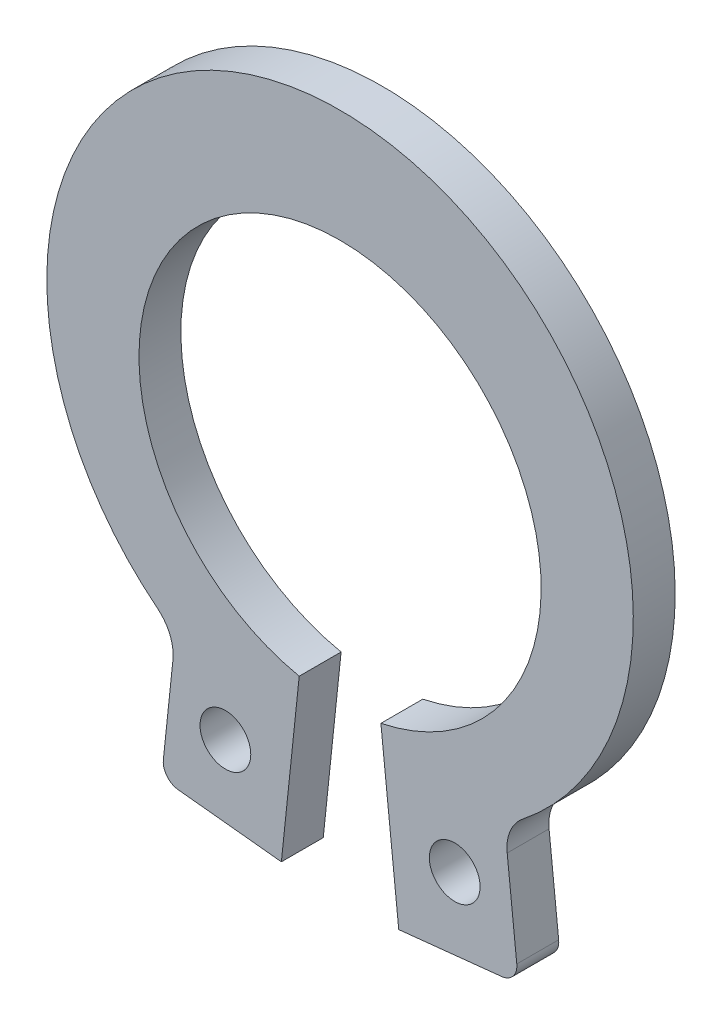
ISO-10303-21;
HEADER;
FILE_DESCRIPTION(('STEP AP214'),'2;1');
FILE_NAME('part.step','',(''),(''),'','','');
FILE_SCHEMA(('AUTOMOTIVE_DESIGN { 1 0 10303 214 1 1 1 1 }'));
ENDSEC;
DATA;
#1=APPLICATION_CONTEXT('core data for automotive mechanical design processes');
#2=APPLICATION_PROTOCOL_DEFINITION('international standard','automotive_design',2000,#1);
#3=PRODUCT_CONTEXT('',#1,'mechanical');
#4=PRODUCT('Part','Part','',(#3));
#5=PRODUCT_RELATED_PRODUCT_CATEGORY('part','',(#4));
#6=PRODUCT_DEFINITION_FORMATION('','',#4);
#7=PRODUCT_DEFINITION_CONTEXT('part definition',#1,'design');
#8=PRODUCT_DEFINITION('design','',#6,#7);
#9=PRODUCT_DEFINITION_SHAPE('','',#8);
#10=(LENGTH_UNIT() NAMED_UNIT(*) SI_UNIT(.MILLI.,.METRE.));
#11=(NAMED_UNIT(*) PLANE_ANGLE_UNIT() SI_UNIT($,.RADIAN.));
#12=(NAMED_UNIT(*) SI_UNIT($,.STERADIAN.) SOLID_ANGLE_UNIT());
#13=UNCERTAINTY_MEASURE_WITH_UNIT(LENGTH_MEASURE(1.E-05),#10,'distance_accuracy_value','');
#14=(GEOMETRIC_REPRESENTATION_CONTEXT(3) GLOBAL_UNCERTAINTY_ASSIGNED_CONTEXT((#13)) GLOBAL_UNIT_ASSIGNED_CONTEXT((#10,
#11,#12)) REPRESENTATION_CONTEXT('',''));
#15=CARTESIAN_POINT('',(0.,0.,0.));
#16=DIRECTION('',(0.,0.,1.));
#17=DIRECTION('',(1.,0.,0.));
#18=AXIS2_PLACEMENT_3D('',#15,#16,#17);
#19=CARTESIAN_POINT('',(0.,0.,1.));
#20=DIRECTION('',(0.,0.,1.));
#21=DIRECTION('',(0.999999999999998,0.,0.));
#22=AXIS2_PLACEMENT_3D('',#19,#20,#21);
#23=PLANE('',#22);
#24=CARTESIAN_POINT('',(2.73698519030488,-6.8963505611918,1.));
#25=DIRECTION('',(0.,0.,1.));
#26=DIRECTION('',(-0.999999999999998,0.,0.));
#27=AXIS2_PLACEMENT_3D('',#24,#25,#26);
#28=CIRCLE('',#27,0.605831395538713);
#29=CARTESIAN_POINT('',(2.13115379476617,-6.8963505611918,1.));
#30=VERTEX_POINT('',#29);
#31=EDGE_CURVE('E137',#30,#30,#28,.T.);
#32=ORIENTED_EDGE('',*,*,#31,.F.);
#33=EDGE_LOOP('',(#32));
#34=FACE_BOUND('',#33,.T.);
#35=CARTESIAN_POINT('',(0.,0.,1.));
#36=DIRECTION('',(0.,0.,-1.));
#37=DIRECTION('',(0.999999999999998,0.,0.));
#38=AXIS2_PLACEMENT_3D('',#35,#36,#37);
#39=CIRCLE('',#38,4.8);
#40=CARTESIAN_POINT('',(-0.974938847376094,-4.69994619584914,0.999999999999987));
#41=VERTEX_POINT('',#40);
#42=CARTESIAN_POINT('',(0.974938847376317,-4.69994619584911,0.999999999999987));
#43=VERTEX_POINT('',#42);
#44=EDGE_CURVE('E163',#41,#43,#39,.T.);
#45=ORIENTED_EDGE('',*,*,#44,.T.);
#46=DIRECTION('',(0.104528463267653,-0.994521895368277,0.));
#47=VECTOR('',#46,1.);
#48=CARTESIAN_POINT('',(1.40075111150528,-8.75127926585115,0.999999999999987));
#49=LINE('',#48,#47);
#50=CARTESIAN_POINT('',(1.40075111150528,-8.75127926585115,0.999999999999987));
#51=VERTEX_POINT('',#50);
#52=EDGE_CURVE('E132',#43,#51,#49,.T.);
#53=ORIENTED_EDGE('',*,*,#52,.T.);
#54=DIRECTION('',(0.994521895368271,0.104528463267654,0.));
#55=VECTOR('',#54,1.);
#56=CARTESIAN_POINT('',(3.86271492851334,-8.49251644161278,0.999999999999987));
#57=LINE('',#56,#55);
#58=CARTESIAN_POINT('',(3.86271492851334,-8.49251644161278,0.999999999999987));
#59=VERTEX_POINT('',#58);
#60=EDGE_CURVE('E166',#51,#59,#57,.T.);
#61=ORIENTED_EDGE('',*,*,#60,.T.);
#62=CARTESIAN_POINT('',(3.82090354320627,-8.09470768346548,0.99999999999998));
#63=DIRECTION('',(0.,0.,1.));
#64=DIRECTION('',(-0.999999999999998,0.,0.));
#65=AXIS2_PLACEMENT_3D('',#62,#63,#64);
#66=CIRCLE('',#65,0.4);
#67=CARTESIAN_POINT('',(4.2187123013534,-8.05289629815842,0.999999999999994));
#68=VERTEX_POINT('',#67);
#69=EDGE_CURVE('E168',#59,#68,#66,.T.);
#70=ORIENTED_EDGE('',*,*,#69,.T.);
#71=DIRECTION('',(-0.104528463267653,0.994521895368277,0.));
#72=VECTOR('',#71,1.);
#73=CARTESIAN_POINT('',(3.98958328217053,-5.87287930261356,0.999999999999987));
#74=LINE('',#73,#72);
#75=CARTESIAN_POINT('',(3.98958328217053,-5.87287930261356,0.999999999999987));
#76=VERTEX_POINT('',#75);
#77=EDGE_CURVE('E170',#68,#76,#74,.T.);
#78=ORIENTED_EDGE('',*,*,#77,.T.);
#79=CARTESIAN_POINT('',(4.98410517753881,-5.76835083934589,0.999999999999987));
#80=DIRECTION('',(0.,0.,-1.));
#81=DIRECTION('',(0.999999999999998,0.,0.));
#82=AXIS2_PLACEMENT_3D('',#79,#80,#81);
#83=CIRCLE('',#82,0.999999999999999);
#84=CARTESIAN_POINT('',(4.36109203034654,-4.98613947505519,0.999999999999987));
#85=VERTEX_POINT('',#84);
#86=EDGE_CURVE('E172',#76,#85,#83,.T.);
#87=ORIENTED_EDGE('',*,*,#86,.T.);
#88=CARTESIAN_POINT('',(0.,0.489340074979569,0.999999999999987));
#89=DIRECTION('',(0.,0.,1.));
#90=DIRECTION('',(-0.999999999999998,0.,0.));
#91=AXIS2_PLACEMENT_3D('',#88,#89,#90);
#92=CIRCLE('',#91,7.);
#93=CARTESIAN_POINT('',(-4.36109203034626,-4.98613947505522,0.999999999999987));
#94=VERTEX_POINT('',#93);
#95=EDGE_CURVE('E174',#85,#94,#92,.T.);
#96=ORIENTED_EDGE('',*,*,#95,.T.);
#97=CARTESIAN_POINT('',(-4.98410517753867,-5.7683508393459,0.999999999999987));
#98=DIRECTION('',(0.,0.,-1.));
#99=DIRECTION('',(-0.999999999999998,0.,0.));
#100=AXIS2_PLACEMENT_3D('',#97,#98,#99);
#101=CIRCLE('',#100,0.999999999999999);
#102=CARTESIAN_POINT('',(-3.98958328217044,-5.87287930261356,1.));
#103=VERTEX_POINT('',#102);
#104=EDGE_CURVE('E176',#94,#103,#101,.T.);
#105=ORIENTED_EDGE('',*,*,#104,.T.);
#106=DIRECTION('',(-0.104528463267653,-0.994521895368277,0.));
#107=VECTOR('',#106,1.);
#108=CARTESIAN_POINT('',(-3.98958328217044,-5.87287930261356,1.));
#109=LINE('',#108,#107);
#110=CARTESIAN_POINT('',(-4.21871230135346,-8.05289629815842,0.999999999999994));
#111=VERTEX_POINT('',#110);
#112=EDGE_CURVE('E178',#103,#111,#109,.T.);
#113=ORIENTED_EDGE('',*,*,#112,.T.);
#114=CARTESIAN_POINT('',(-3.82090354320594,-8.09470768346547,1.));
#115=DIRECTION('',(0.,0.,1.));
#116=DIRECTION('',(0.999999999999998,0.,0.));
#117=AXIS2_PLACEMENT_3D('',#114,#115,#116);
#118=CIRCLE('',#117,0.4);
#119=CARTESIAN_POINT('',(-3.86271492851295,-8.49251644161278,0.99999999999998));
#120=VERTEX_POINT('',#119);
#121=EDGE_CURVE('E180',#111,#120,#118,.T.);
#122=ORIENTED_EDGE('',*,*,#121,.T.);
#123=DIRECTION('',(0.994521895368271,-0.104528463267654,0.));
#124=VECTOR('',#123,1.);
#125=CARTESIAN_POINT('',(-3.86271492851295,-8.49251644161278,0.99999999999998));
#126=LINE('',#125,#124);
#127=CARTESIAN_POINT('',(-1.40075111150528,-8.75127926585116,1.));
#128=VERTEX_POINT('',#127);
#129=EDGE_CURVE('E49',#120,#128,#126,.T.);
#130=ORIENTED_EDGE('',*,*,#129,.T.);
#131=DIRECTION('',(0.104528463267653,0.994521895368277,0.));
#132=VECTOR('',#131,1.);
#133=CARTESIAN_POINT('',(-1.40075111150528,-8.75127926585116,1.));
#134=LINE('',#133,#132);
#135=EDGE_CURVE('E44',#128,#41,#134,.T.);
#136=ORIENTED_EDGE('',*,*,#135,.T.);
#137=EDGE_LOOP('',(#45,#53,#61,#70,#78,#87,#96,#105,#113,#122,#130,#136));
#138=FACE_BOUND('',#137,.T.);
#139=CARTESIAN_POINT('',(-2.73698519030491,-6.8963505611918,1.));
#140=DIRECTION('',(0.,0.,1.));
#141=DIRECTION('',(0.999999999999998,0.,0.));
#142=AXIS2_PLACEMENT_3D('',#139,#140,#141);
#143=CIRCLE('',#142,0.605831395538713);
#144=CARTESIAN_POINT('',(-2.1311537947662,-6.8963505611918,1.));
#145=VERTEX_POINT('',#144);
#146=EDGE_CURVE('E286',#145,#145,#143,.T.);
#147=ORIENTED_EDGE('',*,*,#146,.F.);
#148=EDGE_LOOP('',(#147));
#149=FACE_BOUND('',#148,.T.);
#150=ADVANCED_FACE('F29',(#34,#138,#149),#23,.T.);
#151=CARTESIAN_POINT('',(0.,0.,0.));
#152=DIRECTION('',(0.,0.,1.));
#153=DIRECTION('',(0.999999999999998,0.,0.));
#154=AXIS2_PLACEMENT_3D('',#151,#152,#153);
#155=PLANE('',#154);
#156=CARTESIAN_POINT('',(2.73698519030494,-6.8963505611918,0.));
#157=DIRECTION('',(0.,0.,1.));
#158=DIRECTION('',(-0.999999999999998,0.,0.));
#159=AXIS2_PLACEMENT_3D('',#156,#157,#158);
#160=CIRCLE('',#159,0.605831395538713);
#161=CARTESIAN_POINT('',(2.13115379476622,-6.8963505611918,0.));
#162=VERTEX_POINT('',#161);
#163=EDGE_CURVE('E140',#162,#162,#160,.T.);
#164=ORIENTED_EDGE('',*,*,#163,.T.);
#165=EDGE_LOOP('',(#164));
#166=FACE_BOUND('',#165,.T.);
#167=CARTESIAN_POINT('',(0.,0.,0.));
#168=DIRECTION('',(0.,0.,-1.));
#169=DIRECTION('',(0.999999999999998,0.,0.));
#170=AXIS2_PLACEMENT_3D('',#167,#168,#169);
#171=CIRCLE('',#170,4.8);
#172=CARTESIAN_POINT('',(-0.974938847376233,-4.69994619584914,0.));
#173=VERTEX_POINT('',#172);
#174=CARTESIAN_POINT('',(0.974938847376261,-4.69994619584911,0.));
#175=VERTEX_POINT('',#174);
#176=EDGE_CURVE('E123',#173,#175,#171,.T.);
#177=ORIENTED_EDGE('',*,*,#176,.F.);
#178=DIRECTION('',(0.104528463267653,0.994521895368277,0.));
#179=VECTOR('',#178,1.);
#180=CARTESIAN_POINT('',(-1.40075111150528,-8.75127926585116,0.));
#181=LINE('',#180,#179);
#182=CARTESIAN_POINT('',(-1.40075111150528,-8.75127926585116,0.));
#183=VERTEX_POINT('',#182);
#184=EDGE_CURVE('E161',#183,#173,#181,.T.);
#185=ORIENTED_EDGE('',*,*,#184,.F.);
#186=DIRECTION('',(0.994521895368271,-0.104528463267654,0.));
#187=VECTOR('',#186,1.);
#188=CARTESIAN_POINT('',(-3.86271492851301,-8.49251644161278,0.));
#189=LINE('',#188,#187);
#190=CARTESIAN_POINT('',(-3.86271492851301,-8.49251644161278,0.));
#191=VERTEX_POINT('',#190);
#192=EDGE_CURVE('E159',#191,#183,#189,.T.);
#193=ORIENTED_EDGE('',*,*,#192,.F.);
#194=CARTESIAN_POINT('',(-3.82090354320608,-8.09470768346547,0.));
#195=DIRECTION('',(0.,0.,1.));
#196=DIRECTION('',(0.999999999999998,0.,0.));
#197=AXIS2_PLACEMENT_3D('',#194,#195,#196);
#198=CIRCLE('',#197,0.4);
#199=CARTESIAN_POINT('',(-4.21871230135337,-8.05289629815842,0.));
#200=VERTEX_POINT('',#199);
#201=EDGE_CURVE('E157',#200,#191,#198,.T.);
#202=ORIENTED_EDGE('',*,*,#201,.F.);
#203=DIRECTION('',(-0.104528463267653,-0.994521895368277,0.));
#204=VECTOR('',#203,1.);
#205=CARTESIAN_POINT('',(-3.98958328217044,-5.87287930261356,0.));
#206=LINE('',#205,#204);
#207=CARTESIAN_POINT('',(-3.98958328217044,-5.87287930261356,0.));
#208=VERTEX_POINT('',#207);
#209=EDGE_CURVE('E155',#208,#200,#206,.T.);
#210=ORIENTED_EDGE('',*,*,#209,.F.);
#211=CARTESIAN_POINT('',(-4.98410517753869,-5.7683508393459,0.));
#212=DIRECTION('',(0.,0.,-1.));
#213=DIRECTION('',(-0.999999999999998,0.,0.));
#214=AXIS2_PLACEMENT_3D('',#211,#212,#213);
#215=CIRCLE('',#214,0.999999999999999);
#216=CARTESIAN_POINT('',(-4.3610920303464,-4.98613947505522,0.));
#217=VERTEX_POINT('',#216);
#218=EDGE_CURVE('E153',#217,#208,#215,.T.);
#219=ORIENTED_EDGE('',*,*,#218,.F.);
#220=CARTESIAN_POINT('',(0.,0.489340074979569,0.));
#221=DIRECTION('',(0.,0.,1.));
#222=DIRECTION('',(-0.999999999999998,0.,0.));
#223=AXIS2_PLACEMENT_3D('',#220,#221,#222);
#224=CIRCLE('',#223,7.);
#225=CARTESIAN_POINT('',(4.36109203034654,-4.98613947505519,0.));
#226=VERTEX_POINT('',#225);
#227=EDGE_CURVE('E151',#226,#217,#224,.T.);
#228=ORIENTED_EDGE('',*,*,#227,.F.);
#229=CARTESIAN_POINT('',(4.98410517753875,-5.76835083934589,0.));
#230=DIRECTION('',(0.,0.,-1.));
#231=DIRECTION('',(0.999999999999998,0.,0.));
#232=AXIS2_PLACEMENT_3D('',#229,#230,#231);
#233=CIRCLE('',#232,0.999999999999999);
#234=CARTESIAN_POINT('',(3.98958328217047,-5.87287930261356,0.));
#235=VERTEX_POINT('',#234);
#236=EDGE_CURVE('E149',#235,#226,#233,.T.);
#237=ORIENTED_EDGE('',*,*,#236,.F.);
#238=DIRECTION('',(-0.104528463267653,0.994521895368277,0.));
#239=VECTOR('',#238,1.);
#240=CARTESIAN_POINT('',(3.98958328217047,-5.87287930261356,0.));
#241=LINE('',#240,#239);
#242=CARTESIAN_POINT('',(4.2187123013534,-8.05289629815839,0.));
#243=VERTEX_POINT('',#242);
#244=EDGE_CURVE('E147',#243,#235,#241,.T.);
#245=ORIENTED_EDGE('',*,*,#244,.F.);
#246=CARTESIAN_POINT('',(3.82090354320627,-8.09470768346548,0.));
#247=DIRECTION('',(0.,0.,1.));
#248=DIRECTION('',(-0.999999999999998,0.,0.));
#249=AXIS2_PLACEMENT_3D('',#246,#247,#248);
#250=CIRCLE('',#249,0.4);
#251=CARTESIAN_POINT('',(3.8627149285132,-8.49251644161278,0.));
#252=VERTEX_POINT('',#251);
#253=EDGE_CURVE('E145',#252,#243,#250,.T.);
#254=ORIENTED_EDGE('',*,*,#253,.F.);
#255=DIRECTION('',(0.994521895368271,0.104528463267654,0.));
#256=VECTOR('',#255,1.);
#257=CARTESIAN_POINT('',(3.8627149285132,-8.49251644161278,0.));
#258=LINE('',#257,#256);
#259=CARTESIAN_POINT('',(1.40075111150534,-8.75127926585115,0.));
#260=VERTEX_POINT('',#259);
#261=EDGE_CURVE('E125',#260,#252,#258,.T.);
#262=ORIENTED_EDGE('',*,*,#261,.F.);
#263=DIRECTION('',(0.104528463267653,-0.994521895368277,0.));
#264=VECTOR('',#263,1.);
#265=CARTESIAN_POINT('',(1.40075111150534,-8.75127926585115,0.));
#266=LINE('',#265,#264);
#267=EDGE_CURVE('E118',#175,#260,#266,.T.);
#268=ORIENTED_EDGE('',*,*,#267,.F.);
#269=EDGE_LOOP('',(#177,#185,#193,#202,#210,#219,#228,#237,#245,#254,#262,#268));
#270=FACE_BOUND('',#269,.T.);
#271=CARTESIAN_POINT('',(-2.73698519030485,-6.8963505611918,0.));
#272=DIRECTION('',(0.,0.,1.));
#273=DIRECTION('',(0.999999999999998,0.,0.));
#274=AXIS2_PLACEMENT_3D('',#271,#272,#273);
#275=CIRCLE('',#274,0.605831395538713);
#276=CARTESIAN_POINT('',(-2.13115379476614,-6.8963505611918,0.));
#277=VERTEX_POINT('',#276);
#278=EDGE_CURVE('E283',#277,#277,#275,.T.);
#279=ORIENTED_EDGE('',*,*,#278,.T.);
#280=EDGE_LOOP('',(#279));
#281=FACE_BOUND('',#280,.T.);
#282=ADVANCED_FACE('F119',(#166,#270,#281),#155,.F.);
#283=CARTESIAN_POINT('',(0.,0.,1.));
#284=DIRECTION('',(0.,0.,-1.));
#285=DIRECTION('',(-0.999999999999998,0.,0.));
#286=AXIS2_PLACEMENT_3D('',#283,#284,#285);
#287=CYLINDRICAL_SURFACE('',#286,4.8);
#288=ORIENTED_EDGE('',*,*,#176,.T.);
#289=DIRECTION('',(0.,0.,-1.));
#290=VECTOR('',#289,1.);
#291=CARTESIAN_POINT('',(0.974938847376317,-4.69994619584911,0.999999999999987));
#292=LINE('',#291,#290);
#293=EDGE_CURVE('E11',#43,#175,#292,.T.);
#294=ORIENTED_EDGE('',*,*,#293,.F.);
#295=ORIENTED_EDGE('',*,*,#44,.F.);
#296=DIRECTION('',(0.,0.,-1.));
#297=VECTOR('',#296,1.);
#298=CARTESIAN_POINT('',(-0.974938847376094,-4.69994619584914,0.999999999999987));
#299=LINE('',#298,#297);
#300=EDGE_CURVE('E136',#41,#173,#299,.T.);
#301=ORIENTED_EDGE('',*,*,#300,.T.);
#302=EDGE_LOOP('',(#288,#294,#295,#301));
#303=FACE_BOUND('',#302,.T.);
#304=ADVANCED_FACE('F31',(#303),#287,.F.);
#305=CARTESIAN_POINT('',(1.40075111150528,-8.75127926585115,0.999999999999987));
#306=DIRECTION('',(0.994521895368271,0.104528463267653,0.));
#307=DIRECTION('',(-0.104528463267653,0.994521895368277,0.));
#308=AXIS2_PLACEMENT_3D('',#305,#306,#307);
#309=PLANE('',#308);
#310=ORIENTED_EDGE('',*,*,#267,.T.);
#311=DIRECTION('',(0.,0.,-1.));
#312=VECTOR('',#311,1.);
#313=CARTESIAN_POINT('',(1.40075111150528,-8.75127926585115,0.999999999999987));
#314=LINE('',#313,#312);
#315=EDGE_CURVE('E37',#51,#260,#314,.T.);
#316=ORIENTED_EDGE('',*,*,#315,.F.);
#317=ORIENTED_EDGE('',*,*,#52,.F.);
#318=ORIENTED_EDGE('',*,*,#293,.T.);
#319=EDGE_LOOP('',(#310,#316,#317,#318));
#320=FACE_BOUND('',#319,.T.);
#321=ADVANCED_FACE('F131',(#320),#309,.F.);
#322=CARTESIAN_POINT('',(3.86271492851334,-8.49251644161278,0.999999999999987));
#323=DIRECTION('',(-0.104528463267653,0.994521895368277,0.));
#324=DIRECTION('',(-0.994521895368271,-0.104528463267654,0.));
#325=AXIS2_PLACEMENT_3D('',#322,#323,#324);
#326=PLANE('',#325);
#327=ORIENTED_EDGE('',*,*,#261,.T.);
#328=DIRECTION('',(0.,0.,-1.));
#329=VECTOR('',#328,1.);
#330=CARTESIAN_POINT('',(3.86271492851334,-8.49251644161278,0.999999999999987));
#331=LINE('',#330,#329);
#332=EDGE_CURVE('E209',#59,#252,#331,.T.);
#333=ORIENTED_EDGE('',*,*,#332,.F.);
#334=ORIENTED_EDGE('',*,*,#60,.F.);
#335=ORIENTED_EDGE('',*,*,#315,.T.);
#336=EDGE_LOOP('',(#327,#333,#334,#335));
#337=FACE_BOUND('',#336,.T.);
#338=ADVANCED_FACE('F213',(#337),#326,.F.);
#339=CARTESIAN_POINT('',(3.82090354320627,-8.09470768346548,0.99999999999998));
#340=DIRECTION('',(0.,0.,-1.));
#341=DIRECTION('',(-0.999999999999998,0.,0.));
#342=AXIS2_PLACEMENT_3D('',#339,#340,#341);
#343=CYLINDRICAL_SURFACE('',#342,0.4);
#344=ORIENTED_EDGE('',*,*,#253,.T.);
#345=DIRECTION('',(0.,0.,-1.));
#346=VECTOR('',#345,1.);
#347=CARTESIAN_POINT('',(4.2187123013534,-8.05289629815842,0.999999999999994));
#348=LINE('',#347,#346);
#349=EDGE_CURVE('E206',#68,#243,#348,.T.);
#350=ORIENTED_EDGE('',*,*,#349,.F.);
#351=ORIENTED_EDGE('',*,*,#69,.F.);
#352=ORIENTED_EDGE('',*,*,#332,.T.);
#353=EDGE_LOOP('',(#344,#350,#351,#352));
#354=FACE_BOUND('',#353,.T.);
#355=ADVANCED_FACE('F221',(#354),#343,.T.);
#356=CARTESIAN_POINT('',(3.98958328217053,-5.87287930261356,0.999999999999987));
#357=DIRECTION('',(-0.994521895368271,-0.104528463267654,0.));
#358=DIRECTION('',(0.104528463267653,-0.994521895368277,0.));
#359=AXIS2_PLACEMENT_3D('',#356,#357,#358);
#360=PLANE('',#359);
#361=ORIENTED_EDGE('',*,*,#244,.T.);
#362=DIRECTION('',(0.,0.,-1.));
#363=VECTOR('',#362,1.);
#364=CARTESIAN_POINT('',(3.98958328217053,-5.87287930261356,0.999999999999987));
#365=LINE('',#364,#363);
#366=EDGE_CURVE('E203',#76,#235,#365,.T.);
#367=ORIENTED_EDGE('',*,*,#366,.F.);
#368=ORIENTED_EDGE('',*,*,#77,.F.);
#369=ORIENTED_EDGE('',*,*,#349,.T.);
#370=EDGE_LOOP('',(#361,#367,#368,#369));
#371=FACE_BOUND('',#370,.T.);
#372=ADVANCED_FACE('F224',(#371),#360,.F.);
#373=CARTESIAN_POINT('',(4.98410517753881,-5.76835083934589,0.999999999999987));
#374=DIRECTION('',(0.,0.,-1.));
#375=DIRECTION('',(-0.999999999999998,0.,0.));
#376=AXIS2_PLACEMENT_3D('',#373,#374,#375);
#377=CYLINDRICAL_SURFACE('',#376,0.999999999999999);
#378=ORIENTED_EDGE('',*,*,#236,.T.);
#379=DIRECTION('',(0.,0.,-1.));
#380=VECTOR('',#379,1.);
#381=CARTESIAN_POINT('',(4.36109203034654,-4.98613947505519,0.999999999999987));
#382=LINE('',#381,#380);
#383=EDGE_CURVE('E200',#85,#226,#382,.T.);
#384=ORIENTED_EDGE('',*,*,#383,.F.);
#385=ORIENTED_EDGE('',*,*,#86,.F.);
#386=ORIENTED_EDGE('',*,*,#366,.T.);
#387=EDGE_LOOP('',(#378,#384,#385,#386));
#388=FACE_BOUND('',#387,.T.);
#389=ADVANCED_FACE('F229',(#388),#377,.F.);
#390=CARTESIAN_POINT('',(0.,0.489340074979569,0.999999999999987));
#391=DIRECTION('',(0.,0.,-1.));
#392=DIRECTION('',(-0.999999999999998,0.,0.));
#393=AXIS2_PLACEMENT_3D('',#390,#391,#392);
#394=CYLINDRICAL_SURFACE('',#393,7.);
#395=ORIENTED_EDGE('',*,*,#227,.T.);
#396=DIRECTION('',(0.,0.,-1.));
#397=VECTOR('',#396,1.);
#398=CARTESIAN_POINT('',(-4.36109203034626,-4.98613947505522,0.999999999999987));
#399=LINE('',#398,#397);
#400=EDGE_CURVE('E197',#94,#217,#399,.T.);
#401=ORIENTED_EDGE('',*,*,#400,.F.);
#402=ORIENTED_EDGE('',*,*,#95,.F.);
#403=ORIENTED_EDGE('',*,*,#383,.T.);
#404=EDGE_LOOP('',(#395,#401,#402,#403));
#405=FACE_BOUND('',#404,.T.);
#406=ADVANCED_FACE('F235',(#405),#394,.T.);
#407=CARTESIAN_POINT('',(-4.98410517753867,-5.7683508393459,0.999999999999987));
#408=DIRECTION('',(0.,0.,-1.));
#409=DIRECTION('',(-0.999999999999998,0.,0.));
#410=AXIS2_PLACEMENT_3D('',#407,#408,#409);
#411=CYLINDRICAL_SURFACE('',#410,0.999999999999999);
#412=ORIENTED_EDGE('',*,*,#218,.T.);
#413=DIRECTION('',(0.,0.,-1.));
#414=VECTOR('',#413,1.);
#415=CARTESIAN_POINT('',(-3.98958328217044,-5.87287930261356,1.));
#416=LINE('',#415,#414);
#417=EDGE_CURVE('E194',#103,#208,#416,.T.);
#418=ORIENTED_EDGE('',*,*,#417,.F.);
#419=ORIENTED_EDGE('',*,*,#104,.F.);
#420=ORIENTED_EDGE('',*,*,#400,.T.);
#421=EDGE_LOOP('',(#412,#418,#419,#420));
#422=FACE_BOUND('',#421,.T.);
#423=ADVANCED_FACE('F239',(#422),#411,.F.);
#424=CARTESIAN_POINT('',(-3.98958328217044,-5.87287930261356,1.));
#425=DIRECTION('',(0.994521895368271,-0.104528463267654,0.));
#426=DIRECTION('',(0.104528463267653,0.994521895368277,0.));
#427=AXIS2_PLACEMENT_3D('',#424,#425,#426);
#428=PLANE('',#427);
#429=ORIENTED_EDGE('',*,*,#209,.T.);
#430=DIRECTION('',(0.,0.,-1.));
#431=VECTOR('',#430,1.);
#432=CARTESIAN_POINT('',(-4.21871230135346,-8.05289629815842,0.999999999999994));
#433=LINE('',#432,#431);
#434=EDGE_CURVE('E191',#111,#200,#433,.T.);
#435=ORIENTED_EDGE('',*,*,#434,.F.);
#436=ORIENTED_EDGE('',*,*,#112,.F.);
#437=ORIENTED_EDGE('',*,*,#417,.T.);
#438=EDGE_LOOP('',(#429,#435,#436,#437));
#439=FACE_BOUND('',#438,.T.);
#440=ADVANCED_FACE('F244',(#439),#428,.F.);
#441=CARTESIAN_POINT('',(-3.82090354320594,-8.09470768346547,1.));
#442=DIRECTION('',(0.,0.,-1.));
#443=DIRECTION('',(-0.999999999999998,0.,0.));
#444=AXIS2_PLACEMENT_3D('',#441,#442,#443);
#445=CYLINDRICAL_SURFACE('',#444,0.4);
#446=ORIENTED_EDGE('',*,*,#201,.T.);
#447=DIRECTION('',(0.,0.,-1.));
#448=VECTOR('',#447,1.);
#449=CARTESIAN_POINT('',(-3.86271492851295,-8.49251644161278,0.99999999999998));
#450=LINE('',#449,#448);
#451=EDGE_CURVE('E188',#120,#191,#450,.T.);
#452=ORIENTED_EDGE('',*,*,#451,.F.);
#453=ORIENTED_EDGE('',*,*,#121,.F.);
#454=ORIENTED_EDGE('',*,*,#434,.T.);
#455=EDGE_LOOP('',(#446,#452,#453,#454));
#456=FACE_BOUND('',#455,.T.);
#457=ADVANCED_FACE('F248',(#456),#445,.T.);
#458=CARTESIAN_POINT('',(-3.86271492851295,-8.49251644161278,0.99999999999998));
#459=DIRECTION('',(0.104528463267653,0.994521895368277,0.));
#460=DIRECTION('',(-0.994521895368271,0.104528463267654,0.));
#461=AXIS2_PLACEMENT_3D('',#458,#459,#460);
#462=PLANE('',#461);
#463=ORIENTED_EDGE('',*,*,#192,.T.);
#464=DIRECTION('',(0.,0.,-1.));
#465=VECTOR('',#464,1.);
#466=CARTESIAN_POINT('',(-1.40075111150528,-8.75127926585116,1.));
#467=LINE('',#466,#465);
#468=EDGE_CURVE('E185',#128,#183,#467,.T.);
#469=ORIENTED_EDGE('',*,*,#468,.F.);
#470=ORIENTED_EDGE('',*,*,#129,.F.);
#471=ORIENTED_EDGE('',*,*,#451,.T.);
#472=EDGE_LOOP('',(#463,#469,#470,#471));
#473=FACE_BOUND('',#472,.T.);
#474=ADVANCED_FACE('F252',(#473),#462,.F.);
#475=CARTESIAN_POINT('',(-1.40075111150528,-8.75127926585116,1.));
#476=DIRECTION('',(-0.994521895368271,0.104528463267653,0.));
#477=DIRECTION('',(-0.104528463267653,-0.994521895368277,0.));
#478=AXIS2_PLACEMENT_3D('',#475,#476,#477);
#479=PLANE('',#478);
#480=ORIENTED_EDGE('',*,*,#184,.T.);
#481=ORIENTED_EDGE('',*,*,#300,.F.);
#482=ORIENTED_EDGE('',*,*,#135,.F.);
#483=ORIENTED_EDGE('',*,*,#468,.T.);
#484=EDGE_LOOP('',(#480,#481,#482,#483));
#485=FACE_BOUND('',#484,.T.);
#486=ADVANCED_FACE('F254',(#485),#479,.F.);
#487=CARTESIAN_POINT('',(2.73698519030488,-6.8963505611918,1.));
#488=DIRECTION('',(0.,0.,-1.));
#489=DIRECTION('',(-0.999999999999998,0.,0.));
#490=AXIS2_PLACEMENT_3D('',#487,#488,#489);
#491=CYLINDRICAL_SURFACE('',#490,0.605831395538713);
#492=ORIENTED_EDGE('',*,*,#163,.F.);
#493=EDGE_LOOP('',(#492));
#494=FACE_BOUND('',#493,.T.);
#495=ORIENTED_EDGE('',*,*,#31,.T.);
#496=EDGE_LOOP('',(#495));
#497=FACE_BOUND('',#496,.T.);
#498=ADVANCED_FACE('F256',(#494,#497),#491,.F.);
#499=CARTESIAN_POINT('',(-2.73698519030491,-6.8963505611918,1.));
#500=DIRECTION('',(0.,0.,-1.));
#501=DIRECTION('',(-0.999999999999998,0.,0.));
#502=AXIS2_PLACEMENT_3D('',#499,#500,#501);
#503=CYLINDRICAL_SURFACE('',#502,0.605831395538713);
#504=ORIENTED_EDGE('',*,*,#278,.F.);
#505=EDGE_LOOP('',(#504));
#506=FACE_BOUND('',#505,.T.);
#507=ORIENTED_EDGE('',*,*,#146,.T.);
#508=EDGE_LOOP('',(#507));
#509=FACE_BOUND('',#508,.T.);
#510=ADVANCED_FACE('F262',(#506,#509),#503,.F.);
#511=CLOSED_SHELL('',(#150,#282,#304,#321,#338,#355,#372,#389,#406,#423,#440,#457,#474,#486,
#498,#510));
#512=MANIFOLD_SOLID_BREP('B2',#511);
#513=ADVANCED_BREP_SHAPE_REPRESENTATION('',(#18,#512),#14);
#514=SHAPE_DEFINITION_REPRESENTATION(#9,#513);
ENDSEC;
END-ISO-10303-21;
